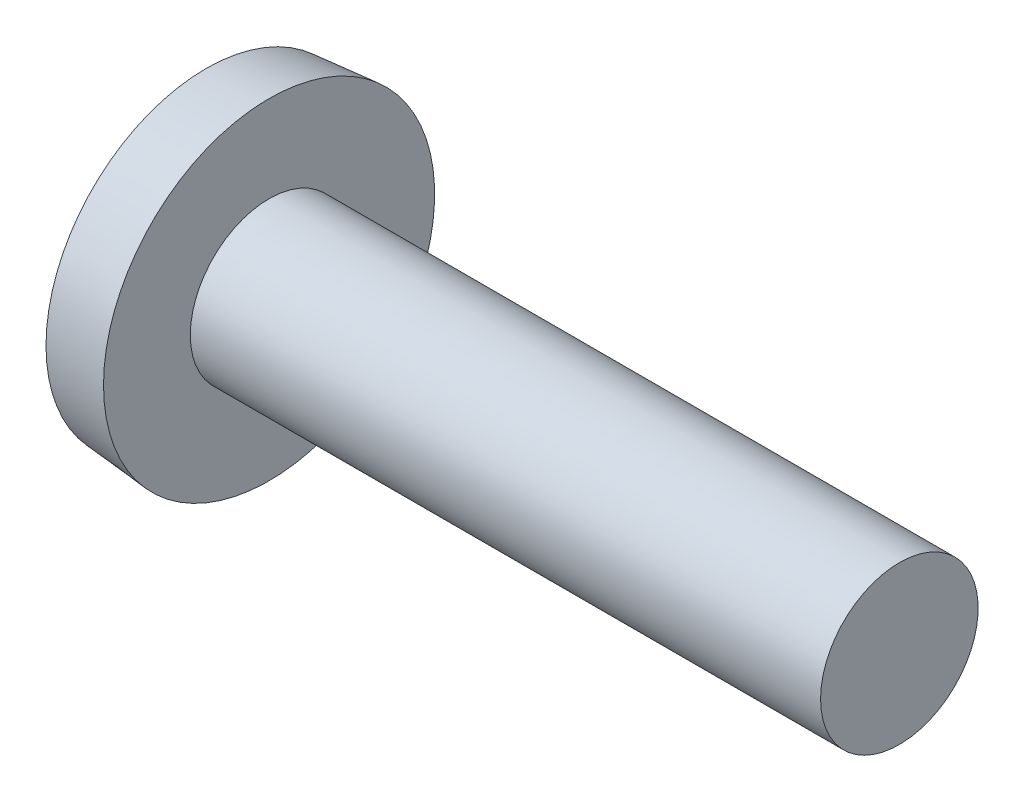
from build123d import *

# Parameters (mm, degrees)
SKETCH2_W         = 20.0152
SKETCH2_H         = 1.7018
SLOT_DEPTH        = 2.2606
CIRPATTERN1_COUNT = 2
CIRPATTERN1_ANGLE = 90


with BuildPart() as part:
    # BodySke → Base-Revolve (revolve)
    with BuildSketch(Plane.XY, mode=Mode.PRIVATE) as base_revolve_sk:
        with BuildLine():
            Line((6.1976, 4.7625), (6.1976, 10.0076))
            Line((6.1976, 10.0076), (2.3876, 9.674268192))
            ThreePointArc((2.3876, 9.674268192), (0.605722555, 4.982271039), (0, 0))
            Line((0, 0), (44.2976, 0))
            Line((44.2976, 0), (44.2976, 4.7625))
            Line((44.2976, 4.7625), (6.1976, 4.7625))
        make_face()
    revolve(base_revolve_sk.sketch.rotate(Axis((-25.4, 0, 0), (1, 0, 0)), 90), axis=Axis((-25.4, 0, 0), (1, 0, 0)))

    # Sketch2 → Slot (cut)
    with BuildSketch(Plane(origin=(0, 0, 0), x_dir=(0, 0, -1), z_dir=(1, 0, 0))):
        Rectangle(SKETCH2_W, SKETCH2_H)
    extrude(amount=SLOT_DEPTH, mode=Mode.SUBTRACT)

    # Sketch3 → Cross section 0
    with BuildSketch(Plane(origin=(0, 0, 0), x_dir=(0, 0, -1), z_dir=(1, 0, 0))):
        with BuildLine():
            Line((-1.0287, 6.096), (1.0287, 6.096))
            Line((1.0287, 6.096), (1.0287, -6.096))
            Line((1.0287, -6.096), (-1.0287, -6.096))
            Line((-1.0287, -6.096), (-1.0287, 6.096))
        make_face()
    # Sketch4 → Cross section 1
    with BuildSketch(Plane(origin=(4.3434, 0, 0), x_dir=(0, 0, -1), z_dir=(1, 0, 0))):
        with BuildLine():
            Line((-0.51435, 0.51435), (0.51435, 0.51435))
            Line((0.51435, 0.51435), (0.51435, -0.51435))
            Line((0.51435, -0.51435), (-0.51435, -0.51435))
            Line((-0.51435, -0.51435), (-0.51435, 0.51435))
        make_face()
    cross = loft(mode=Mode.SUBTRACT)

    # CirPattern1: Cross ×2 about axis
    cirpattern1_axis = Axis((0, 0, 0), (1, 0, 0))
    for i in range(1, CIRPATTERN1_COUNT):
        add(cross.rotate(cirpattern1_axis, i * CIRPATTERN1_ANGLE / (CIRPATTERN1_COUNT - 1)), mode=Mode.SUBTRACT)


solid = part.part
